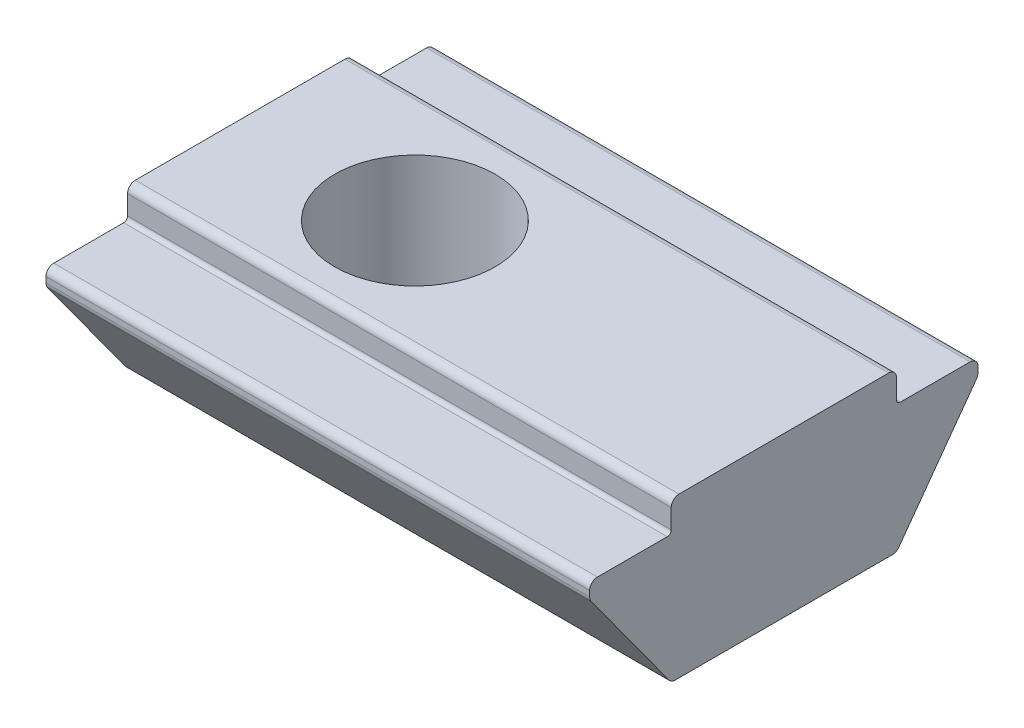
from build123d import *

# Parameters (mm, degrees)
BOSS_EXTRUDE1_DEPTH = 14
FILLET1_R           = 0.1
FILLET2_R           = 0.2
SKETCH2_W           = 1.75
SKETCH2_H           = 1.05
TAP1_D              = 4.134


with BuildPart() as part:
    # Sketch1 → Boss-Extrude1 (new body)
    with BuildSketch(Plane(origin=(-4.5, 0, 0), x_dir=(0, 0, -1), z_dir=(1, 0, 0))):
        Polygon((2.9, -3.3), (-2.9, -3.3), (-5, -0.409597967), (-5, 0), (-2.9, 0), (-2.9, 0.8), (2.9, 0.8), (2.9, 0), (5, 0), (5, -0.409597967), align=None)
    extrude(amount=BOSS_EXTRUDE1_DEPTH)

    # Fillet1
    fillet1_edges = [part.edges().sort_by_distance(p)[0] for p in [
        (2.5, 0, -2.9),
        (2.5, 0, 2.9),
    ]]
    fillet(fillet1_edges, radius=FILLET1_R)

    # Fillet2
    fillet2_edges = [part.edges().sort_by_distance(p)[0] for p in [
        (2.5, 0.8, 2.9),
        (2.5, 0.8, -2.9),
        (2.5, 0, -5),
        (2.5, -0.409597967, -5),
        (2.5, -3.3, -2.9),
        (2.5, -3.3, 2.9),
        (2.5, -0.409597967, 5),
        (2.5, 0, 5),
    ]]
    fillet(fillet2_edges, radius=FILLET2_R)

    # Sketch2 → Cut-Revolve1 (revolve, cut)
    with BuildSketch(Plane(origin=(6, 0, 0), x_dir=(0, 0, -1), z_dir=(1, 0, 0)), mode=Mode.PRIVATE) as cut_revolve1_sk:
        with Locations((0.875, -2.775)):
            Rectangle(SKETCH2_W, SKETCH2_H)
    revolve(cut_revolve1_sk.sketch.rotate(Axis((6, 0, 0), (0, -1, 0)), 180), axis=Axis((6, 0, 0), (0, -1, 0)), mode=Mode.SUBTRACT)

    # Sketch3 → Revolve1 (revolve)
    with BuildSketch(Plane(origin=(6, 0, 0), x_dir=(0, 0, -1), z_dir=(1, 0, 0))):
        with BuildLine():
            Line((-1.75, -2.25), (0, -2.25))
            Line((0, -2.25), (0, -4))
            ThreePointArc((0, -4), (-1.237436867, -3.487436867), (-1.75, -2.25))
        make_face()
    revolve(axis=Axis((6, 0, 0), (0, -1, 0)))

    # Tap1 (through all)
    with Locations(Plane(origin=(0, 0.8, 0), x_dir=(1, 0, 0), z_dir=(0, 1, 0))):
        with Locations((0, 0)):
            Hole(TAP1_D / 2)


solid = part.part
